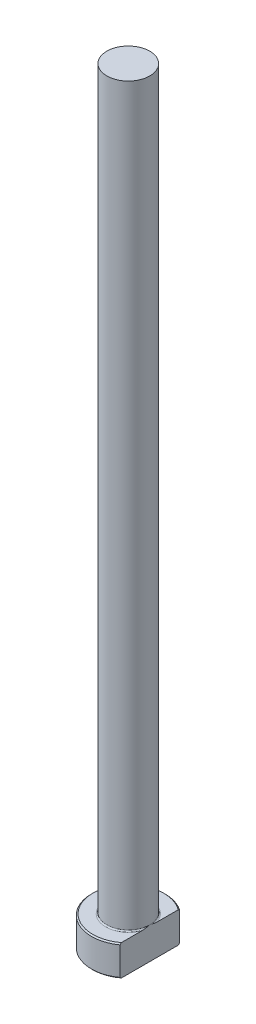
ISO-10303-21;
HEADER;
FILE_DESCRIPTION(('STEP AP214'),'2;1');
FILE_NAME('part.step','',(''),(''),'','','');
FILE_SCHEMA(('AUTOMOTIVE_DESIGN { 1 0 10303 214 1 1 1 1 }'));
ENDSEC;
DATA;
#1=APPLICATION_CONTEXT('core data for automotive mechanical design processes');
#2=APPLICATION_PROTOCOL_DEFINITION('international standard','automotive_design',2000,#1);
#3=PRODUCT_CONTEXT('',#1,'mechanical');
#4=PRODUCT('Part','Part','',(#3));
#5=PRODUCT_RELATED_PRODUCT_CATEGORY('part','',(#4));
#6=PRODUCT_DEFINITION_FORMATION('','',#4);
#7=PRODUCT_DEFINITION_CONTEXT('part definition',#1,'design');
#8=PRODUCT_DEFINITION('design','',#6,#7);
#9=PRODUCT_DEFINITION_SHAPE('','',#8);
#10=(LENGTH_UNIT() NAMED_UNIT(*) SI_UNIT(.MILLI.,.METRE.));
#11=(NAMED_UNIT(*) PLANE_ANGLE_UNIT() SI_UNIT($,.RADIAN.));
#12=(NAMED_UNIT(*) SI_UNIT($,.STERADIAN.) SOLID_ANGLE_UNIT());
#13=UNCERTAINTY_MEASURE_WITH_UNIT(LENGTH_MEASURE(1.E-05),#10,'distance_accuracy_value','');
#14=(GEOMETRIC_REPRESENTATION_CONTEXT(3) GLOBAL_UNCERTAINTY_ASSIGNED_CONTEXT((#13)) GLOBAL_UNIT_ASSIGNED_CONTEXT((#10,
#11,#12)) REPRESENTATION_CONTEXT('',''));
#15=CARTESIAN_POINT('',(0.,0.,0.));
#16=DIRECTION('',(0.,0.,1.));
#17=DIRECTION('',(1.,0.,0.));
#18=AXIS2_PLACEMENT_3D('',#15,#16,#17);
#19=CARTESIAN_POINT('',(0.,0.,0.));
#20=DIRECTION('',(0.,-1.,0.));
#21=DIRECTION('',(0.,0.,-1.));
#22=AXIS2_PLACEMENT_3D('',#19,#20,#21);
#23=PLANE('',#22);
#24=CARTESIAN_POINT('',(0.,0.,0.));
#25=DIRECTION('',(0.,-1.,0.));
#26=DIRECTION('',(0.,0.,-1.));
#27=AXIS2_PLACEMENT_3D('',#24,#25,#26);
#28=CIRCLE('',#27,5.79999999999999);
#29=CARTESIAN_POINT('',(3.49999999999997,0.,4.62493243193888));
#30=VERTEX_POINT('',#29);
#31=CARTESIAN_POINT('',(3.49999999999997,0.,-4.62493243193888));
#32=VERTEX_POINT('',#31);
#33=EDGE_CURVE('E98',#30,#32,#28,.T.);
#34=ORIENTED_EDGE('',*,*,#33,.T.);
#35=DIRECTION('',(0.,0.,1.));
#36=VECTOR('',#35,1.);
#37=CARTESIAN_POINT('',(3.49999999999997,0.,-4.87339717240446));
#38=LINE('',#37,#36);
#39=EDGE_CURVE('E83',#32,#30,#38,.T.);
#40=ORIENTED_EDGE('',*,*,#39,.T.);
#41=EDGE_LOOP('',(#34,#40));
#42=FACE_BOUND('',#41,.T.);
#43=ADVANCED_FACE('F32',(#42),#23,.T.);
#44=CARTESIAN_POINT('',(0.,259.958771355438,0.));
#45=DIRECTION('',(0.,1.,0.));
#46=DIRECTION('',(0.,0.,1.));
#47=AXIS2_PLACEMENT_3D('',#44,#45,#46);
#48=CYLINDRICAL_SURFACE('',#47,5.99999999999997);
#49=CARTESIAN_POINT('',(0.,4.79999999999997,0.));
#50=DIRECTION('',(0.,1.,0.));
#51=DIRECTION('',(0.,0.,1.));
#52=AXIS2_PLACEMENT_3D('',#49,#50,#51);
#53=CIRCLE('',#52,5.99999999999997);
#54=CARTESIAN_POINT('',(3.49999999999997,4.79999999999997,4.87339717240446));
#55=VERTEX_POINT('',#54);
#56=CARTESIAN_POINT('',(3.49999999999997,4.79999999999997,-4.87339717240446));
#57=VERTEX_POINT('',#56);
#58=EDGE_CURVE('E104',#55,#57,#53,.F.);
#59=ORIENTED_EDGE('',*,*,#58,.T.);
#60=DIRECTION('',(0.,-1.,0.));
#61=VECTOR('',#60,1.);
#62=CARTESIAN_POINT('',(3.49999999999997,125.,-4.87339717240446));
#63=LINE('',#62,#61);
#64=CARTESIAN_POINT('',(3.49999999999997,0.199999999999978,-4.87339717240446));
#65=VERTEX_POINT('',#64);
#66=EDGE_CURVE('E183',#57,#65,#63,.T.);
#67=ORIENTED_EDGE('',*,*,#66,.T.);
#68=CARTESIAN_POINT('',(0.,0.199999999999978,0.));
#69=DIRECTION('',(0.,-1.,0.));
#70=DIRECTION('',(0.,0.,-1.));
#71=AXIS2_PLACEMENT_3D('',#68,#69,#70);
#72=CIRCLE('',#71,5.99999999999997);
#73=CARTESIAN_POINT('',(3.49999999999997,0.199999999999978,4.87339717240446));
#74=VERTEX_POINT('',#73);
#75=EDGE_CURVE('E100',#65,#74,#72,.F.);
#76=ORIENTED_EDGE('',*,*,#75,.T.);
#77=DIRECTION('',(0.,-1.,0.));
#78=VECTOR('',#77,1.);
#79=CARTESIAN_POINT('',(3.49999999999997,125.,4.87339717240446));
#80=LINE('',#79,#78);
#81=EDGE_CURVE('E93',#55,#74,#80,.T.);
#82=ORIENTED_EDGE('',*,*,#81,.F.);
#83=EDGE_LOOP('',(#59,#67,#76,#82));
#84=FACE_BOUND('',#83,.T.);
#85=ADVANCED_FACE('F158',(#84),#48,.T.);
#86=CARTESIAN_POINT('',(-5.99999999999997,5.,0.));
#87=DIRECTION('',(0.,1.,0.));
#88=DIRECTION('',(0.,0.,1.));
#89=AXIS2_PLACEMENT_3D('',#86,#87,#88);
#90=PLANE('',#89);
#91=CARTESIAN_POINT('',(0.,5.,0.));
#92=DIRECTION('',(0.,1.,0.));
#93=DIRECTION('',(0.,0.,1.));
#94=AXIS2_PLACEMENT_3D('',#91,#92,#93);
#95=CIRCLE('',#94,5.79999999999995);
#96=CARTESIAN_POINT('',(3.49999999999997,5.,-4.62493243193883));
#97=VERTEX_POINT('',#96);
#98=CARTESIAN_POINT('',(3.49999999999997,5.,4.62493243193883));
#99=VERTEX_POINT('',#98);
#100=EDGE_CURVE('E178',#97,#99,#95,.T.);
#101=ORIENTED_EDGE('',*,*,#100,.T.);
#102=DIRECTION('',(0.,0.,-1.));
#103=VECTOR('',#102,1.);
#104=CARTESIAN_POINT('',(3.49999999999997,5.,0.));
#105=LINE('',#104,#103);
#106=CARTESIAN_POINT('',(3.49999999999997,4.99999999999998,1.19999999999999));
#107=VERTEX_POINT('',#106);
#108=EDGE_CURVE('E57',#99,#107,#105,.T.);
#109=ORIENTED_EDGE('',*,*,#108,.T.);
#110=CARTESIAN_POINT('',(0.,5.,0.));
#111=DIRECTION('',(0.,1.,0.));
#112=DIRECTION('',(0.,0.,1.));
#113=AXIS2_PLACEMENT_3D('',#110,#111,#112);
#114=CIRCLE('',#113,3.69999999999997);
#115=CARTESIAN_POINT('',(3.49999999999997,4.99999999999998,-1.19999999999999));
#116=VERTEX_POINT('',#115);
#117=EDGE_CURVE('E107',#107,#116,#114,.F.);
#118=ORIENTED_EDGE('',*,*,#117,.T.);
#119=EDGE_CURVE('E136',#116,#97,#105,.T.);
#120=ORIENTED_EDGE('',*,*,#119,.T.);
#121=EDGE_LOOP('',(#101,#109,#118,#120));
#122=FACE_BOUND('',#121,.T.);
#123=ADVANCED_FACE('F147',(#122),#90,.T.);
#124=CARTESIAN_POINT('',(0.,5.,0.));
#125=DIRECTION('',(0.,-1.,0.));
#126=DIRECTION('',(0.,0.,-1.));
#127=AXIS2_PLACEMENT_3D('',#124,#125,#126);
#128=CONICAL_SURFACE('',#127,5.79999999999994,0.785398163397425);
#129=ORIENTED_EDGE('',*,*,#58,.F.);
#130=CARTESIAN_POINT('',(3.49999999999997,-0.479658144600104,10.7229048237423));
#131=CARTESIAN_POINT('',(3.49999999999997,-0.304627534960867,10.5387821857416));
#132=CARTESIAN_POINT('',(3.49999999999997,-0.129820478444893,10.3544468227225));
#133=CARTESIAN_POINT('',(3.49999999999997,0.219261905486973,9.9852712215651));
#134=CARTESIAN_POINT('',(3.49999999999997,0.393537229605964,9.80043098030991));
#135=CARTESIAN_POINT('',(3.49999999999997,0.915594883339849,9.24486752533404));
#136=CARTESIAN_POINT('',(3.49999999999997,1.26244829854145,8.87327020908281));
#137=CARTESIAN_POINT('',(3.49999999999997,1.95718621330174,8.12195979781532));
#138=CARTESIAN_POINT('',(3.49999999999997,2.30502483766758,7.74220412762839));
#139=CARTESIAN_POINT('',(3.49999999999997,2.82267860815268,7.16898192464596));
#140=CARTESIAN_POINT('',(3.49999999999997,2.99451670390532,6.97734293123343));
#141=CARTESIAN_POINT('',(3.49999999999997,3.3364922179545,6.59255347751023));
#142=CARTESIAN_POINT('',(3.49999999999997,3.50662964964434,6.39940302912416));
#143=CARTESIAN_POINT('',(3.49999999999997,3.80984794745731,6.05127590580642));
#144=CARTESIAN_POINT('',(3.49999999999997,3.94332939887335,5.89664839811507));
#145=CARTESIAN_POINT('',(3.49999999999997,4.20861192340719,5.58595941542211));
#146=CARTESIAN_POINT('',(3.49999999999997,4.34041301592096,5.42989795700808));
#147=CARTESIAN_POINT('',(3.49999999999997,4.60204886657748,5.11587234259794));
#148=CARTESIAN_POINT('',(3.49999999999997,4.73188156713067,4.95790646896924));
#149=CARTESIAN_POINT('',(3.49999999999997,4.98887681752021,4.63982145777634));
#150=CARTESIAN_POINT('',(3.49999999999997,5.11603946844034,4.479702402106));
#151=CARTESIAN_POINT('',(3.49999999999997,5.36664013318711,4.1571264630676));
#152=CARTESIAN_POINT('',(3.49999999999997,5.49008567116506,3.99467544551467));
#153=CARTESIAN_POINT('',(3.49999999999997,5.73245687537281,3.6663703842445));
#154=CARTESIAN_POINT('',(3.49999999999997,5.85138169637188,3.50051571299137));
#155=CARTESIAN_POINT('',(3.49999999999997,6.08288587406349,3.16479623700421));
#156=CARTESIAN_POINT('',(3.49999999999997,6.19547497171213,2.99493819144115));
#157=CARTESIAN_POINT('',(3.49999999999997,6.41208556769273,2.64987956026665));
#158=CARTESIAN_POINT('',(3.49999999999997,6.5161111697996,2.47468158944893));
#159=CARTESIAN_POINT('',(3.49999999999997,6.68667355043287,2.16371702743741));
#160=CARTESIAN_POINT('',(3.49999999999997,6.75595020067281,2.02946380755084));
#161=CARTESIAN_POINT('',(3.49999999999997,6.88572771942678,1.75668071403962));
#162=CARTESIAN_POINT('',(3.49999999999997,6.94622644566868,1.61814980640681));
#163=CARTESIAN_POINT('',(3.49999999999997,7.05535730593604,1.33751093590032));
#164=CARTESIAN_POINT('',(3.49999999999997,7.10406788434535,1.19543397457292));
#165=CARTESIAN_POINT('',(3.49999999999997,7.18698872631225,0.907101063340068));
#166=CARTESIAN_POINT('',(3.49999999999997,7.22121012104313,0.76084841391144));
#167=CARTESIAN_POINT('',(3.49999999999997,7.26487302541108,0.507831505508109));
#168=CARTESIAN_POINT('',(3.49999999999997,7.27861043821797,0.401805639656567));
#169=CARTESIAN_POINT('',(3.49999999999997,7.29650595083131,0.188947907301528));
#170=CARTESIAN_POINT('',(3.49999999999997,7.30066582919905,0.0821161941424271));
#171=CARTESIAN_POINT('',(3.49999999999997,7.29916002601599,-0.131492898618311));
#172=CARTESIAN_POINT('',(3.49999999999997,7.29349282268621,-0.238270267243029));
#173=CARTESIAN_POINT('',(3.49999999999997,7.27266406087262,-0.450895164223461));
#174=CARTESIAN_POINT('',(3.49999999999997,7.25750065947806,-0.556742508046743));
#175=CARTESIAN_POINT('',(3.49999999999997,7.21256554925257,-0.798589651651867));
#176=CARTESIAN_POINT('',(3.49999999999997,7.17976248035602,-0.934025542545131));
#177=CARTESIAN_POINT('',(3.49999999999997,7.10180151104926,-1.20127435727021));
#178=CARTESIAN_POINT('',(3.49999999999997,7.05663717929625,-1.33308535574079));
#179=CARTESIAN_POINT('',(3.49999999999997,6.95617548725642,-1.59358719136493));
#180=CARTESIAN_POINT('',(3.49999999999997,6.90082290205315,-1.72225647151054));
#181=CARTESIAN_POINT('',(3.49999999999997,6.81196782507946,-1.9124686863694));
#182=CARTESIAN_POINT('',(3.49999999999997,6.78138093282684,-1.97540288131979));
#183=CARTESIAN_POINT('',(3.49999999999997,6.71848328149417,-2.1004037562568));
#184=CARTESIAN_POINT('',(3.49999999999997,6.68617255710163,-2.1624704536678));
#185=CARTESIAN_POINT('',(3.49999999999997,6.59348343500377,-2.33529342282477));
#186=CARTESIAN_POINT('',(3.49999999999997,6.53139715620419,-2.44513435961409));
#187=CARTESIAN_POINT('',(3.49999999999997,6.40327495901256,-2.66249790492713));
#188=CARTESIAN_POINT('',(3.49999999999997,6.33723828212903,-2.77002006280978));
#189=CARTESIAN_POINT('',(3.49999999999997,6.20193961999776,-2.9831092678));
#190=CARTESIAN_POINT('',(3.49999999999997,6.13267551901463,-3.08867496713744));
#191=CARTESIAN_POINT('',(3.49999999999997,5.99154722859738,-3.29805772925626));
#192=CARTESIAN_POINT('',(3.49999999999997,5.91968285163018,-3.40187466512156));
#193=CARTESIAN_POINT('',(3.49999999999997,5.70053198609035,-3.71160333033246));
#194=CARTESIAN_POINT('',(3.49999999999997,5.55004115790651,-3.91524708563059));
#195=CARTESIAN_POINT('',(3.49999999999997,5.24323373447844,-4.31793623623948));
#196=CARTESIAN_POINT('',(3.49999999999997,5.08691924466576,-4.51698325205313));
#197=CARTESIAN_POINT('',(3.49999999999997,4.76917008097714,-4.91272714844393));
#198=CARTESIAN_POINT('',(3.49999999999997,4.60771212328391,-5.10940527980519));
#199=CARTESIAN_POINT('',(3.49999999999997,4.28159454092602,-5.50010578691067));
#200=CARTESIAN_POINT('',(3.49999999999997,4.1169346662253,-5.69412795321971));
#201=CARTESIAN_POINT('',(3.49999999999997,3.78544370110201,-6.07977702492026));
#202=CARTESIAN_POINT('',(3.49999999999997,3.61861641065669,-6.27140720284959));
#203=CARTESIAN_POINT('',(3.49999999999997,3.28306967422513,-6.65300504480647));
#204=CARTESIAN_POINT('',(3.49999999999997,3.11435020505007,-6.84297268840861));
#205=CARTESIAN_POINT('',(3.49999999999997,2.66324311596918,-7.34687370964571));
#206=CARTESIAN_POINT('',(3.49999999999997,2.37954008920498,-7.65962881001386));
#207=CARTESIAN_POINT('',(3.49999999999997,1.80910784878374,-8.28261634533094));
#208=CARTESIAN_POINT('',(3.49999999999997,1.52237733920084,-8.59284759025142));
#209=CARTESIAN_POINT('',(3.49999999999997,0.950562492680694,-9.2072768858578));
#210=CARTESIAN_POINT('',(3.49999999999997,0.665505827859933,-9.5115007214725));
#211=CARTESIAN_POINT('',(3.49999999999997,0.0939335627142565,-10.118297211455));
#212=CARTESIAN_POINT('',(3.49999999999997,-0.192581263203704,-10.4208705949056));
#213=CARTESIAN_POINT('',(3.49999999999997,-0.479658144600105,-10.7229048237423));
#214=B_SPLINE_CURVE_WITH_KNOTS('',3,(#130,#131,#132,#133,#134,#135,#136,#137,#138,#139,#140,
#141,#142,#143,#144,#145,#146,#147,#148,#149,#150,#151,#152,#153,#154,#155,#156,#157,#158,#159,
#160,#161,#162,#163,#164,#165,#166,#167,#168,#169,#170,#171,#172,#173,#174,#175,#176,#177,#178,
#179,#180,#181,#182,#183,#184,#185,#186,#187,#188,#189,#190,#191,#192,#193,#194,#195,#196,#197,
#198,#199,#200,#201,#202,#203,#204,#205,#206,#207,#208,#209,#210,#211,#212,#213),.UNSPECIFIED.,
.F.,.F.,(4,2,2,2,2,2,2,2,2,2,2,2,2,2,2,2,2,2,2,2,2,2,2,2,2,2,2,2,2,2,2,2,2,2,2,2,2,2,2,2,2,4),
(0.,0.762123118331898,1.52425095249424,3.04920520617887,4.59410962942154,5.36629689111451,
6.13847806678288,6.75128402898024,7.36408291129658,7.97748343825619,8.59086070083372,
9.20289910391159,9.81505138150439,10.4262352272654,11.0371244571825,11.4901076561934,
11.9432012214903,12.3931912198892,12.8428348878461,13.1631796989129,13.4834650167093,
13.8037999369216,14.1241970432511,14.5415079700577,14.9590364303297,15.3788985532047,
15.5887982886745,15.7986938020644,16.1771020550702,16.5555831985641,16.9343160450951,
17.3130762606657,18.0725457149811,18.8317432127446,19.5950831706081,20.3584829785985,
21.1206884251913,21.8829032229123,23.1496528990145,24.4169687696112,25.6676760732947,
26.9177769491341),.UNSPECIFIED.);
#215=EDGE_CURVE('E135',#55,#99,#214,.T.);
#216=ORIENTED_EDGE('',*,*,#215,.T.);
#217=ORIENTED_EDGE('',*,*,#100,.F.);
#218=EDGE_CURVE('E127',#97,#57,#214,.T.);
#219=ORIENTED_EDGE('',*,*,#218,.T.);
#220=EDGE_LOOP('',(#129,#216,#217,#219));
#221=FACE_BOUND('',#220,.T.);
#222=ADVANCED_FACE('F143',(#221),#128,.T.);
#223=CARTESIAN_POINT('',(0.,0.199999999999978,0.));
#224=DIRECTION('',(0.,1.,0.));
#225=DIRECTION('',(0.,0.,1.));
#226=AXIS2_PLACEMENT_3D('',#223,#224,#225);
#227=CONICAL_SURFACE('',#226,5.99999999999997,0.785398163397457);
#228=ORIENTED_EDGE('',*,*,#75,.F.);
#229=CARTESIAN_POINT('',(3.49999999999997,5.47965814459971,-10.7229048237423));
#230=CARTESIAN_POINT('',(3.49999999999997,5.30462753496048,-10.5387821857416));
#231=CARTESIAN_POINT('',(3.49999999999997,5.12982047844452,-10.3544468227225));
#232=CARTESIAN_POINT('',(3.49999999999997,4.78073809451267,-9.98527122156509));
#233=CARTESIAN_POINT('',(3.49999999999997,4.60646277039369,-9.8004309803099));
#234=CARTESIAN_POINT('',(3.49999999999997,4.08440511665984,-9.24486752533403));
#235=CARTESIAN_POINT('',(3.49999999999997,3.73755170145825,-8.8732702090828));
#236=CARTESIAN_POINT('',(3.49999999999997,3.042813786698,-8.12195979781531));
#237=CARTESIAN_POINT('',(3.49999999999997,2.69497516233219,-7.74220412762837));
#238=CARTESIAN_POINT('',(3.49999999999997,2.17732139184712,-7.16898192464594));
#239=CARTESIAN_POINT('',(3.49999999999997,2.00548329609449,-6.9773429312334));
#240=CARTESIAN_POINT('',(3.49999999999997,1.66350778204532,-6.5925534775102));
#241=CARTESIAN_POINT('',(3.49999999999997,1.4933703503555,-6.39940302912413));
#242=CARTESIAN_POINT('',(3.49999999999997,1.19015205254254,-6.05127590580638));
#243=CARTESIAN_POINT('',(3.49999999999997,1.05667060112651,-5.89664839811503));
#244=CARTESIAN_POINT('',(3.49999999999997,0.791388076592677,-5.58595941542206));
#245=CARTESIAN_POINT('',(3.49999999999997,0.659586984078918,-5.42989795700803));
#246=CARTESIAN_POINT('',(3.49999999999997,0.397951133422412,-5.11587234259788));
#247=CARTESIAN_POINT('',(3.49999999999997,0.268118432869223,-4.95790646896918));
#248=CARTESIAN_POINT('',(3.49999999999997,0.0111231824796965,-4.63982145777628));
#249=CARTESIAN_POINT('',(3.49999999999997,-0.11603946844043,-4.47970240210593));
#250=CARTESIAN_POINT('',(3.49999999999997,-0.366640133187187,-4.15712646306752));
#251=CARTESIAN_POINT('',(3.49999999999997,-0.490085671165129,-3.99467544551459));
#252=CARTESIAN_POINT('',(3.49999999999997,-0.73245687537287,-3.66637038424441));
#253=CARTESIAN_POINT('',(3.49999999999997,-0.851381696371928,-3.50051571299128));
#254=CARTESIAN_POINT('',(3.49999999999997,-1.08288587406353,-3.16479623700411));
#255=CARTESIAN_POINT('',(3.49999999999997,-1.19547497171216,-2.99493819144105));
#256=CARTESIAN_POINT('',(3.49999999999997,-1.41208556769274,-2.64987956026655));
#257=CARTESIAN_POINT('',(3.49999999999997,-1.5161111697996,-2.47468158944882));
#258=CARTESIAN_POINT('',(3.49999999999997,-1.68667355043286,-2.16371702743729));
#259=CARTESIAN_POINT('',(3.49999999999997,-1.7559502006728,-2.02946380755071));
#260=CARTESIAN_POINT('',(3.49999999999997,-1.88572771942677,-1.75668071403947));
#261=CARTESIAN_POINT('',(3.49999999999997,-1.94622644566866,-1.61814980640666));
#262=CARTESIAN_POINT('',(3.49999999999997,-2.05535730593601,-1.33751093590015));
#263=CARTESIAN_POINT('',(3.49999999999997,-2.10406788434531,-1.19543397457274));
#264=CARTESIAN_POINT('',(3.49999999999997,-2.18698872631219,-0.907101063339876));
#265=CARTESIAN_POINT('',(3.49999999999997,-2.22121012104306,-0.760848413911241));
#266=CARTESIAN_POINT('',(3.49999999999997,-2.26487302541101,-0.507831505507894));
#267=CARTESIAN_POINT('',(3.49999999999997,-2.27861043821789,-0.401805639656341));
#268=CARTESIAN_POINT('',(3.49999999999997,-2.29650595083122,-0.188947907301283));
#269=CARTESIAN_POINT('',(3.49999999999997,-2.30066582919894,-0.0821161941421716));
#270=CARTESIAN_POINT('',(3.49999999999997,-2.29916002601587,0.131492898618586));
#271=CARTESIAN_POINT('',(3.49999999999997,-2.29349282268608,0.238270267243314));
#272=CARTESIAN_POINT('',(3.49999999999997,-2.27266406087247,0.450895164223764));
#273=CARTESIAN_POINT('',(3.49999999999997,-2.2575006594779,0.556742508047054));
#274=CARTESIAN_POINT('',(3.49999999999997,-2.21256554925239,0.798589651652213));
#275=CARTESIAN_POINT('',(3.49999999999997,-2.17976248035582,0.934025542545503));
#276=CARTESIAN_POINT('',(3.49999999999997,-2.10180151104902,1.20127435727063));
#277=CARTESIAN_POINT('',(3.49999999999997,-2.05663717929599,1.33308535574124));
#278=CARTESIAN_POINT('',(3.49999999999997,-1.95617548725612,1.59358719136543));
#279=CARTESIAN_POINT('',(3.49999999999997,-1.90082290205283,1.72225647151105));
#280=CARTESIAN_POINT('',(3.49999999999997,-1.81196782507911,1.91246868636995));
#281=CARTESIAN_POINT('',(3.49999999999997,-1.78138093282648,1.97540288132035));
#282=CARTESIAN_POINT('',(3.49999999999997,-1.71848328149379,2.10040375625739));
#283=CARTESIAN_POINT('',(3.49999999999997,-1.68617255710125,2.1624704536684));
#284=CARTESIAN_POINT('',(3.49999999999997,-1.59348343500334,2.33529342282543));
#285=CARTESIAN_POINT('',(3.49999999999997,-1.53139715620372,2.44513435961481));
#286=CARTESIAN_POINT('',(3.49999999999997,-1.40327495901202,2.66249790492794));
#287=CARTESIAN_POINT('',(3.49999999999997,-1.33723828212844,2.77002006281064));
#288=CARTESIAN_POINT('',(3.49999999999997,-1.20193961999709,2.98310926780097));
#289=CARTESIAN_POINT('',(3.49999999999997,-1.13267551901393,3.08867496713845));
#290=CARTESIAN_POINT('',(3.49999999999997,-0.991547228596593,3.29805772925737));
#291=CARTESIAN_POINT('',(3.49999999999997,-0.919682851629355,3.40187466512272));
#292=CARTESIAN_POINT('',(3.49999999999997,-0.700531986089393,3.71160333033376));
#293=CARTESIAN_POINT('',(3.49999999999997,-0.550041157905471,3.91524708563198));
#294=CARTESIAN_POINT('',(3.49999999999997,-0.243233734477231,4.31793623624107));
#295=CARTESIAN_POINT('',(3.49999999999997,-0.0869192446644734,4.5169832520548));
#296=CARTESIAN_POINT('',(3.49999999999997,0.230829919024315,4.91272714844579));
#297=CARTESIAN_POINT('',(3.49999999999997,0.392287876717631,5.10940527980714));
#298=CARTESIAN_POINT('',(3.49999999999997,0.718405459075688,5.50010578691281));
#299=CARTESIAN_POINT('',(3.49999999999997,0.883065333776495,5.69412795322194));
#300=CARTESIAN_POINT('',(3.49999999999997,1.21455629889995,6.07977702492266));
#301=CARTESIAN_POINT('',(3.49999999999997,1.38138358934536,6.27140720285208));
#302=CARTESIAN_POINT('',(3.49999999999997,1.71693032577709,6.65300504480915));
#303=CARTESIAN_POINT('',(3.49999999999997,1.88564979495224,6.84297268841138));
#304=CARTESIAN_POINT('',(3.49999999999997,2.33675688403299,7.34687370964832));
#305=CARTESIAN_POINT('',(3.49999999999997,2.62045991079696,7.65962881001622));
#306=CARTESIAN_POINT('',(3.49999999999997,3.19089215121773,8.28261634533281));
#307=CARTESIAN_POINT('',(3.49999999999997,3.4776226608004,8.59284759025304));
#308=CARTESIAN_POINT('',(3.49999999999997,4.04943750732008,9.20727688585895));
#309=CARTESIAN_POINT('',(3.49999999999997,4.33449417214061,9.51150072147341));
#310=CARTESIAN_POINT('',(3.49999999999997,4.90606643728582,10.1182972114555));
#311=CARTESIAN_POINT('',(3.49999999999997,5.19258126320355,10.4208705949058));
#312=CARTESIAN_POINT('',(3.49999999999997,5.47965814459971,10.7229048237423));
#313=B_SPLINE_CURVE_WITH_KNOTS('',3,(#229,#230,#231,#232,#233,#234,#235,#236,#237,#238,#239,
#240,#241,#242,#243,#244,#245,#246,#247,#248,#249,#250,#251,#252,#253,#254,#255,#256,#257,#258,
#259,#260,#261,#262,#263,#264,#265,#266,#267,#268,#269,#270,#271,#272,#273,#274,#275,#276,#277,
#278,#279,#280,#281,#282,#283,#284,#285,#286,#287,#288,#289,#290,#291,#292,#293,#294,#295,#296,
#297,#298,#299,#300,#301,#302,#303,#304,#305,#306,#307,#308,#309,#310,#311,#312),.UNSPECIFIED.,
.F.,.F.,(4,2,2,2,2,2,2,2,2,2,2,2,2,2,2,2,2,2,2,2,2,2,2,2,2,2,2,2,2,2,2,2,2,2,2,2,2,2,2,2,2,4),
(0.,0.762123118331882,1.52425095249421,3.0492052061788,4.59410962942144,5.36629689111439,
6.13847806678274,6.7512840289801,7.36408291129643,7.97748343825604,8.59086070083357,
9.20289910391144,9.81505138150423,10.4262352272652,11.0371244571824,11.4901076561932,
11.9432012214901,12.3931912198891,12.842834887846,13.1631796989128,13.4834650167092,
13.8037999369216,14.1241970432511,14.5415079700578,14.9590364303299,15.378898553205,
15.5887982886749,15.7986938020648,16.1771020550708,16.5555831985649,16.934316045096,
17.3130762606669,18.0725457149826,18.8317432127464,19.5950831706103,20.3584829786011,
21.1206884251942,21.8829032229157,23.1496528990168,24.4169687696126,25.667676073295,
26.9177769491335),.UNSPECIFIED.);
#314=EDGE_CURVE('E86',#65,#32,#313,.T.);
#315=ORIENTED_EDGE('',*,*,#314,.T.);
#316=ORIENTED_EDGE('',*,*,#33,.F.);
#317=EDGE_CURVE('E89',#30,#74,#313,.T.);
#318=ORIENTED_EDGE('',*,*,#317,.T.);
#319=EDGE_LOOP('',(#228,#315,#316,#318));
#320=FACE_BOUND('',#319,.T.);
#321=ADVANCED_FACE('F97',(#320),#227,.T.);
#322=CARTESIAN_POINT('',(0.,5.19999999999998,0.));
#323=DIRECTION('',(0.,1.,0.));
#324=DIRECTION('',(0.,0.,1.));
#325=AXIS2_PLACEMENT_3D('',#322,#323,#324);
#326=TOROIDAL_SURFACE('',#325,3.69999999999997,0.2);
#327=CARTESIAN_POINT('',(3.49999999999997,5.19999999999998,0.));
#328=CARTESIAN_POINT('',(3.49999999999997,5.20000050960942,9.98094828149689E-11));
#329=CARTESIAN_POINT('',(3.49999999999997,5.20000101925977,-2.13486746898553E-07));
#330=CARTESIAN_POINT('',(3.49999999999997,5.20000196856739,-7.957591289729E-07));
#331=CARTESIAN_POINT('',(3.49999999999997,5.20000239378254,-1.17925839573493E-06));
#332=CARTESIAN_POINT('',(3.49999999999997,5.20000328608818,-2.10014972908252E-06));
#333=CARTESIAN_POINT('',(3.49999999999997,5.20000373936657,-2.65249908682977E-06));
#334=CARTESIAN_POINT('',(3.49999999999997,5.20000454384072,-3.79112889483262E-06));
#335=CARTESIAN_POINT('',(3.49999999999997,5.20000489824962,-4.37533521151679E-06));
#336=CARTESIAN_POINT('',(3.49999999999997,5.20000623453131,-6.66270059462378E-06));
#337=CARTESIAN_POINT('',(3.49999999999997,5.20000714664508,-8.40961025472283E-06));
#338=CARTESIAN_POINT('',(3.49999999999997,5.20000862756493,-1.18496824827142E-05));
#339=CARTESIAN_POINT('',(3.49999999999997,5.20000922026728,-1.35329548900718E-05));
#340=CARTESIAN_POINT('',(3.49999999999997,5.20001174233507,-2.07268950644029E-05));
#341=CARTESIAN_POINT('',(3.49999999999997,5.20001365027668,-2.62477536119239E-05));
#342=CARTESIAN_POINT('',(3.49999999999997,5.20001642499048,-3.66274572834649E-05));
#343=CARTESIAN_POINT('',(3.49999999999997,5.20001740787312,-4.14549355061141E-05));
#344=CARTESIAN_POINT('',(3.49999999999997,5.20002462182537,-7.75352102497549E-05));
#345=CARTESIAN_POINT('',(3.49999999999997,5.20003014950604,-0.000108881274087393));
#346=CARTESIAN_POINT('',(3.49999999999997,5.20005434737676,-0.000233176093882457));
#347=CARTESIAN_POINT('',(3.49999999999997,5.20007737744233,-0.000325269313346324));
#348=CARTESIAN_POINT('',(3.49999999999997,5.20016742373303,-0.000691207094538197));
#349=CARTESIAN_POINT('',(3.49999999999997,5.20023166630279,-0.000965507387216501));
#350=CARTESIAN_POINT('',(3.49999999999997,5.20048971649,-0.0020594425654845));
#351=CARTESIAN_POINT('',(3.49999999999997,5.20068705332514,-0.00287847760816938));
#352=CARTESIAN_POINT('',(3.49999999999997,5.20150941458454,-0.00630050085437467));
#353=CARTESIAN_POINT('',(3.49999999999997,5.20212997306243,-0.00890424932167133));
#354=CARTESIAN_POINT('',(3.49999999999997,5.20703918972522,-0.0294912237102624));
#355=CARTESIAN_POINT('',(3.49999999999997,5.21134300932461,-0.0474719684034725));
#356=CARTESIAN_POINT('',(3.49999999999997,5.21975360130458,-0.0827191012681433));
#357=CARTESIAN_POINT('',(3.49999999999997,5.22386136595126,-0.0999852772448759));
#358=CARTESIAN_POINT('',(3.49999999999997,5.2372401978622,-0.156405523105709));
#359=CARTESIAN_POINT('',(3.49999999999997,5.24645854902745,-0.195572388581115));
#360=CARTESIAN_POINT('',(3.49999999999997,5.26203234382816,-0.262828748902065));
#361=CARTESIAN_POINT('',(3.49999999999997,5.26845671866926,-0.290902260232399));
#362=CARTESIAN_POINT('',(3.49999999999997,5.28094671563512,-0.346379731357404));
#363=CARTESIAN_POINT('',(3.49999999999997,5.28701730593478,-0.373782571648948));
#364=CARTESIAN_POINT('',(3.49999999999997,5.30077691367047,-0.437211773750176));
#365=CARTESIAN_POINT('',(3.49999999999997,5.3083789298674,-0.473257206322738));
#366=CARTESIAN_POINT('',(3.49999999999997,5.32309409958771,-0.545736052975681));
#367=CARTESIAN_POINT('',(3.49999999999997,5.33020304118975,-0.582170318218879));
#368=CARTESIAN_POINT('',(3.49999999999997,5.35161649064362,-0.697757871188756));
#369=CARTESIAN_POINT('',(3.49999999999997,5.36463967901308,-0.777158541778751));
#370=CARTESIAN_POINT('',(3.49999999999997,5.3843837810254,-0.92756184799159));
#371=CARTESIAN_POINT('',(3.49999999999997,5.39165512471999,-0.998486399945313));
#372=CARTESIAN_POINT('',(3.49999999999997,5.3979989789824,-1.10437287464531));
#373=CARTESIAN_POINT('',(3.49999999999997,5.39936233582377,-1.13919451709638));
#374=CARTESIAN_POINT('',(3.49999999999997,5.40028946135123,-1.20885098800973));
#375=CARTESIAN_POINT('',(3.49999999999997,5.39985418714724,-1.24368579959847));
#376=CARTESIAN_POINT('',(3.49999999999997,5.39686573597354,-1.30963279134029));
#377=CARTESIAN_POINT('',(3.49999999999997,5.39453835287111,-1.34075403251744));
#378=CARTESIAN_POINT('',(3.49999999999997,5.38750048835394,-1.40298456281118));
#379=CARTESIAN_POINT('',(3.49999999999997,5.38277118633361,-1.43409178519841));
#380=CARTESIAN_POINT('',(3.49999999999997,5.37000596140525,-1.49609278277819));
#381=CARTESIAN_POINT('',(3.49999999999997,5.36193044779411,-1.52697933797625));
#382=CARTESIAN_POINT('',(3.49999999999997,5.34614337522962,-1.57192957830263));
#383=CARTESIAN_POINT('',(3.49999999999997,5.3402919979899,-1.5866404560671));
#384=CARTESIAN_POINT('',(3.49999999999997,5.32701491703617,-1.6153215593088));
#385=CARTESIAN_POINT('',(3.49999999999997,5.31959341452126,-1.6292936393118));
#386=CARTESIAN_POINT('',(3.49999999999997,5.30547056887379,-1.65150372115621));
#387=CARTESIAN_POINT('',(3.49999999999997,5.29934759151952,-1.6601058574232));
#388=CARTESIAN_POINT('',(3.49999999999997,5.28595656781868,-1.67637400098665));
#389=CARTESIAN_POINT('',(3.49999999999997,5.27869146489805,-1.68404232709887));
#390=CARTESIAN_POINT('',(3.49999999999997,5.26587375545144,-1.69518467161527));
#391=CARTESIAN_POINT('',(3.49999999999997,5.26073958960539,-1.69913647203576));
#392=CARTESIAN_POINT('',(3.49999999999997,5.24994100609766,-1.70624293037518));
#393=CARTESIAN_POINT('',(3.49999999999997,5.24427723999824,-1.70939855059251));
#394=CARTESIAN_POINT('',(3.49999999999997,5.23351378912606,-1.71418736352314));
#395=CARTESIAN_POINT('',(3.49999999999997,5.22849079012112,-1.71599090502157));
#396=CARTESIAN_POINT('',(3.49999999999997,5.21821361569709,-1.71873268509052));
#397=CARTESIAN_POINT('',(3.49999999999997,5.21295968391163,-1.71967181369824));
#398=CARTESIAN_POINT('',(3.49999999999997,5.20234462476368,-1.72059432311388));
#399=CARTESIAN_POINT('',(3.49999999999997,5.19698314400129,-1.72057373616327));
#400=CARTESIAN_POINT('',(3.49999999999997,5.18635093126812,-1.71956893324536));
#401=CARTESIAN_POINT('',(3.49999999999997,5.18108024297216,-1.71858426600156));
#402=CARTESIAN_POINT('',(3.49999999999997,5.17106869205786,-1.71582968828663));
#403=CARTESIAN_POINT('',(3.49999999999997,5.16631466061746,-1.71410641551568));
#404=CARTESIAN_POINT('',(3.49999999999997,5.15709718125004,-1.71001459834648));
#405=CARTESIAN_POINT('',(3.49999999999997,5.15263381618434,-1.70764587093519));
#406=CARTESIAN_POINT('',(3.49999999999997,5.14110717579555,-1.70060771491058));
#407=CARTESIAN_POINT('',(3.49999999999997,5.13433222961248,-1.69546710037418));
#408=CARTESIAN_POINT('',(3.49999999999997,5.12164557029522,-1.68420869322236));
#409=CARTESIAN_POINT('',(3.49999999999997,5.11573697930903,-1.67808752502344));
#410=CARTESIAN_POINT('',(3.49999999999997,5.10028952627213,-1.66008531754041));
#411=CARTESIAN_POINT('',(3.49999999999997,5.09159238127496,-1.64748936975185));
#412=CARTESIAN_POINT('',(3.49999999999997,5.07604019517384,-1.62125022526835));
#413=CARTESIAN_POINT('',(3.49999999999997,5.06918749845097,-1.60760572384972));
#414=CARTESIAN_POINT('',(3.49999999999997,5.05635908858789,-1.57851190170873));
#415=CARTESIAN_POINT('',(3.49999999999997,5.05050870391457,-1.56300807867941));
#416=CARTESIAN_POINT('',(3.49999999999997,5.04009412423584,-1.53156759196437));
#417=CARTESIAN_POINT('',(3.49999999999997,5.03553147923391,-1.51563043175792));
#418=CARTESIAN_POINT('',(3.49999999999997,5.02331191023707,-1.46712048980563));
#419=CARTESIAN_POINT('',(3.49999999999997,5.01724153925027,-1.4341495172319));
#420=CARTESIAN_POINT('',(3.49999999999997,5.00883071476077,-1.37348993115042));
#421=CARTESIAN_POINT('',(3.49999999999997,5.00603148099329,-1.34585663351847));
#422=CARTESIAN_POINT('',(3.49999999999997,5.00204762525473,-1.29046925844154));
#423=CARTESIAN_POINT('',(3.49999999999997,5.00086336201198,-1.26271515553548));
#424=CARTESIAN_POINT('',(3.49999999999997,4.99925913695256,-1.17922229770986));
#425=CARTESIAN_POINT('',(3.49999999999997,5.00080993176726,-1.1234488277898));
#426=CARTESIAN_POINT('',(3.49999999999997,5.00738569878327,-1.01528124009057));
#427=CARTESIAN_POINT('',(3.49999999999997,5.01221131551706,-0.962872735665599));
#428=CARTESIAN_POINT('',(3.49999999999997,5.02425367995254,-0.858750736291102));
#429=CARTESIAN_POINT('',(3.49999999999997,5.03145152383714,-0.807035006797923));
#430=CARTESIAN_POINT('',(3.49999999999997,5.04786442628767,-0.702500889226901));
#431=CARTESIAN_POINT('',(3.49999999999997,5.05712869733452,-0.649690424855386));
#432=CARTESIAN_POINT('',(3.49999999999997,5.07730630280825,-0.542969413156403));
#433=CARTESIAN_POINT('',(3.49999999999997,5.08825618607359,-0.489065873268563));
#434=CARTESIAN_POINT('',(3.49999999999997,5.10770336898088,-0.397738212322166));
#435=CARTESIAN_POINT('',(3.49999999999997,5.11594150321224,-0.360258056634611));
#436=CARTESIAN_POINT('',(3.49999999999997,5.1326812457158,-0.285797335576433));
#437=CARTESIAN_POINT('',(3.49999999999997,5.14117887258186,-0.248815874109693));
#438=CARTESIAN_POINT('',(3.49999999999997,5.15740628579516,-0.179140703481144));
#439=CARTESIAN_POINT('',(3.49999999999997,5.16511243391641,-0.146441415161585));
#440=CARTESIAN_POINT('',(3.49999999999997,5.18096853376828,-0.0796648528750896));
#441=CARTESIAN_POINT('',(3.49999999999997,5.18912333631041,-0.045588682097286));
#442=CARTESIAN_POINT('',(3.49999999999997,5.19787118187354,-0.00889903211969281));
#443=CARTESIAN_POINT('',(3.49999999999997,5.19849305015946,-0.00629009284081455));
#444=CARTESIAN_POINT('',(3.49999999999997,5.19931571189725,-0.00286690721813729));
#445=CARTESIAN_POINT('',(3.49999999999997,5.19951207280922,-0.0020519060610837));
#446=CARTESIAN_POINT('',(3.49999999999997,5.19976893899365,-0.0009629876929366));
#447=CARTESIAN_POINT('',(3.49999999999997,5.19983295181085,-0.00068966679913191));
#448=CARTESIAN_POINT('',(3.49999999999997,5.19992272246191,-0.000324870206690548));
#449=CARTESIAN_POINT('',(3.49999999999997,5.19994571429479,-0.000232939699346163));
#450=CARTESIAN_POINT('',(3.49999999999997,5.19996987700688,-0.000108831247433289));
#451=CARTESIAN_POINT('',(3.49999999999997,5.19997540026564,-7.75074375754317E-05));
#452=CARTESIAN_POINT('',(3.49999999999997,5.19998260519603,-4.1449950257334E-05));
#453=CARTESIAN_POINT('',(3.49999999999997,5.19998358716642,-3.66236562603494E-05));
#454=CARTESIAN_POINT('',(3.49999999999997,5.19998635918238,-2.62464271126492E-05));
#455=CARTESIAN_POINT('',(3.49999999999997,5.19998826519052,-2.07267962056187E-05));
#456=CARTESIAN_POINT('',(3.49999999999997,5.19999078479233,-1.353414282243E-05));
#457=CARTESIAN_POINT('',(3.49999999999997,5.19999137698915,-1.18509583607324E-05));
#458=CARTESIAN_POINT('',(3.49999999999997,5.19999285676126,-8.4109834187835E-06));
#459=CARTESIAN_POINT('',(3.49999999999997,5.19999376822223,-6.66407126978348E-06));
#460=CARTESIAN_POINT('',(3.49999999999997,5.19999510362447,-4.37661194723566E-06));
#461=CARTESIAN_POINT('',(3.49999999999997,5.19999545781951,-3.79235333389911E-06));
#462=CARTESIAN_POINT('',(3.49999999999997,5.19999626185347,-2.65358032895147E-06));
#463=CARTESIAN_POINT('',(3.49999999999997,5.19999671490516,-2.10113839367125E-06));
#464=CARTESIAN_POINT('',(3.49999999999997,5.1999976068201,-1.18003190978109E-06));
#465=CARTESIAN_POINT('',(3.49999999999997,5.19999803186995,-7.96418762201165E-07));
#466=CARTESIAN_POINT('',(3.49999999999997,5.19999898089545,-2.13855187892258E-07));
#467=CARTESIAN_POINT('',(3.49999999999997,5.19999949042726,-9.98022935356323E-11));
#468=CARTESIAN_POINT('',(3.49999999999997,5.19999999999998,0.));
#469=B_SPLINE_CURVE_WITH_KNOTS('',3,(#327,#328,#329,#330,#331,#332,#333,#334,#335,#336,#337,
#338,#339,#340,#341,#342,#343,#344,#345,#346,#347,#348,#349,#350,#351,#352,#353,#354,#355,#356,
#357,#358,#359,#360,#361,#362,#363,#364,#365,#366,#367,#368,#369,#370,#371,#372,#373,#374,#375,
#376,#377,#378,#379,#380,#381,#382,#383,#384,#385,#386,#387,#388,#389,#390,#391,#392,#393,#394,
#395,#396,#397,#398,#399,#400,#401,#402,#403,#404,#405,#406,#407,#408,#409,#410,#411,#412,#413,
#414,#415,#416,#417,#418,#419,#420,#421,#422,#423,#424,#425,#426,#427,#428,#429,#430,#431,#432,
#433,#434,#435,#436,#437,#438,#439,#440,#441,#442,#443,#444,#445,#446,#447,#448,#449,#450,#451,
#452,#453,#454,#455,#456,#457,#458,#459,#460,#461,#462,#463,#464,#465,#466,#467,#468),
.UNSPECIFIED.,.T.,.F.,(4,2,2,2,2,2,2,2,2,2,2,2,2,2,2,2,2,2,2,2,2,2,2,2,2,2,2,2,2,2,2,2,2,2,2,2,
2,2,2,2,2,2,2,2,2,2,2,2,2,2,2,2,2,2,2,2,2,2,2,2,2,2,2,2,2,2,2,2,2,2,4),(0.,1.54778905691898E-06,
3.27068856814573E-06,5.40032147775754E-06,7.44938901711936E-06,1.3341290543E-05,
1.86900588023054E-05,3.61865044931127E-05,5.09488028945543E-05,0.000146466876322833,
0.000431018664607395,0.0012764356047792,0.00380354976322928,0.0118339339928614,
0.0672984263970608,0.120543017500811,0.24125328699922,0.327650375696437,0.411851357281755,
0.52236238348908,0.633723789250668,0.875007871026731,1.08869711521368,1.19320699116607,
1.29766126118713,1.39121331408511,1.4855099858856,1.58095571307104,1.62839133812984,
1.67570160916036,1.70731126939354,1.73884076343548,1.75822424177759,1.77758417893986,
1.79352969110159,1.80945876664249,1.82545370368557,1.84145613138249,1.8565700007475,
1.8716881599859,1.89705349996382,1.92250811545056,1.96816999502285,2.01388964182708,
2.06352392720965,2.11321770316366,2.21356505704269,2.29684564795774,2.3801447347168,
2.54733140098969,2.70515844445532,2.86175703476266,3.02258329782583,3.18758220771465,
3.30270498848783,3.41653913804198,3.51732480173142,3.62243689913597,3.63048332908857,
3.63299799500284,3.63384039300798,3.63412444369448,3.6342198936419,3.63423465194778,
3.63425214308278,3.63425749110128,3.63426338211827,3.63426543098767,3.63426756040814,
3.63426928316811,3.63427083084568),.UNSPECIFIED.);
#470=CARTESIAN_POINT('',(3.49999999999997,5.19999999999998,0.));
#471=VERTEX_POINT('',#470);
#472=EDGE_CURVE('E11',#116,#471,#469,.T.);
#473=ORIENTED_EDGE('',*,*,#472,.F.);
#474=ORIENTED_EDGE('',*,*,#117,.F.);
#475=CARTESIAN_POINT('',(3.49999999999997,5.19999999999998,0.));
#476=CARTESIAN_POINT('',(3.49999999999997,5.19999949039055,-9.98094430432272E-11));
#477=CARTESIAN_POINT('',(3.49999999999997,5.1999989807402,2.1348674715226E-07));
#478=CARTESIAN_POINT('',(3.49999999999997,5.19999803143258,7.95759129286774E-07));
#479=CARTESIAN_POINT('',(3.49999999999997,5.19999760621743,1.17925839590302E-06));
#480=CARTESIAN_POINT('',(3.49999999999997,5.19999671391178,2.10014972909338E-06));
#481=CARTESIAN_POINT('',(3.49999999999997,5.1999962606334,2.65249908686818E-06));
#482=CARTESIAN_POINT('',(3.49999999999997,5.19999545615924,3.79112889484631E-06));
#483=CARTESIAN_POINT('',(3.49999999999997,5.19999510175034,4.37533521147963E-06));
#484=CARTESIAN_POINT('',(3.49999999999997,5.19999376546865,6.66270059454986E-06));
#485=CARTESIAN_POINT('',(3.49999999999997,5.19999285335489,8.40961025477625E-06));
#486=CARTESIAN_POINT('',(3.49999999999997,5.19999137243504,1.18496824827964E-05));
#487=CARTESIAN_POINT('',(3.49999999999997,5.19999077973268,1.35329548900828E-05));
#488=CARTESIAN_POINT('',(3.49999999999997,5.19998825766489,2.07268950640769E-05));
#489=CARTESIAN_POINT('',(3.49999999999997,5.19998634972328,2.62477536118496E-05));
#490=CARTESIAN_POINT('',(3.49999999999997,5.19998357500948,3.66274572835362E-05));
#491=CARTESIAN_POINT('',(3.49999999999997,5.19998259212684,4.14549355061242E-05));
#492=CARTESIAN_POINT('',(3.49999999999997,5.1999753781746,7.75352102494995E-05));
#493=CARTESIAN_POINT('',(3.49999999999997,5.19996985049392,0.000108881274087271));
#494=CARTESIAN_POINT('',(3.49999999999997,5.1999456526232,0.000233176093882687));
#495=CARTESIAN_POINT('',(3.49999999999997,5.19992262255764,0.000325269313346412));
#496=CARTESIAN_POINT('',(3.49999999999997,5.19983257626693,0.000691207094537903));
#497=CARTESIAN_POINT('',(3.49999999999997,5.19976833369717,0.000965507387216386));
#498=CARTESIAN_POINT('',(3.49999999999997,5.19951028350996,0.00205944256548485));
#499=CARTESIAN_POINT('',(3.49999999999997,5.19931294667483,0.00287847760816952));
#500=CARTESIAN_POINT('',(3.49999999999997,5.19849058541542,0.00630050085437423));
#501=CARTESIAN_POINT('',(3.49999999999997,5.19787002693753,0.00890424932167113));
#502=CARTESIAN_POINT('',(3.49999999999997,5.19296081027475,0.0294912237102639));
#503=CARTESIAN_POINT('',(3.49999999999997,5.18865699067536,0.0474719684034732));
#504=CARTESIAN_POINT('',(3.49999999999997,5.18024639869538,0.0827191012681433));
#505=CARTESIAN_POINT('',(3.49999999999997,5.1761386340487,0.0999852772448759));
#506=CARTESIAN_POINT('',(3.49999999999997,5.16275980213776,0.15640552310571));
#507=CARTESIAN_POINT('',(3.49999999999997,5.15354145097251,0.195572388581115));
#508=CARTESIAN_POINT('',(3.49999999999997,5.1379676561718,0.262828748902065));
#509=CARTESIAN_POINT('',(3.49999999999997,5.13154328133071,0.290902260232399));
#510=CARTESIAN_POINT('',(3.49999999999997,5.11905328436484,0.346379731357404));
#511=CARTESIAN_POINT('',(3.49999999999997,5.11298269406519,0.373782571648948));
#512=CARTESIAN_POINT('',(3.49999999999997,5.09922308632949,0.437211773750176));
#513=CARTESIAN_POINT('',(3.49999999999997,5.09162107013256,0.473257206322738));
#514=CARTESIAN_POINT('',(3.49999999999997,5.07690590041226,0.545736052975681));
#515=CARTESIAN_POINT('',(3.49999999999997,5.06979695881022,0.582170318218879));
#516=CARTESIAN_POINT('',(3.49999999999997,5.04838350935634,0.697757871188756));
#517=CARTESIAN_POINT('',(3.49999999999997,5.03536032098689,0.777158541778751));
#518=CARTESIAN_POINT('',(3.49999999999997,5.01561621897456,0.92756184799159));
#519=CARTESIAN_POINT('',(3.49999999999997,5.00834487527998,0.998486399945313));
#520=CARTESIAN_POINT('',(3.49999999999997,5.00200102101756,1.10437287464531));
#521=CARTESIAN_POINT('',(3.49999999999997,5.00063766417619,1.13919451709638));
#522=CARTESIAN_POINT('',(3.49999999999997,4.99971053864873,1.20885098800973));
#523=CARTESIAN_POINT('',(3.49999999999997,5.00014581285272,1.24368579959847));
#524=CARTESIAN_POINT('',(3.49999999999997,5.00313426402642,1.30963279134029));
#525=CARTESIAN_POINT('',(3.49999999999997,5.00546164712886,1.34075403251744));
#526=CARTESIAN_POINT('',(3.49999999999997,5.01249951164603,1.40298456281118));
#527=CARTESIAN_POINT('',(3.49999999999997,5.01722881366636,1.43409178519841));
#528=CARTESIAN_POINT('',(3.49999999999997,5.02999403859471,1.49609278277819));
#529=CARTESIAN_POINT('',(3.49999999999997,5.03806955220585,1.52697933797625));
#530=CARTESIAN_POINT('',(3.49999999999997,5.05385662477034,1.57192957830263));
#531=CARTESIAN_POINT('',(3.49999999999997,5.05970800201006,1.5866404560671));
#532=CARTESIAN_POINT('',(3.49999999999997,5.0729850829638,1.6153215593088));
#533=CARTESIAN_POINT('',(3.49999999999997,5.0804065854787,1.6292936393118));
#534=CARTESIAN_POINT('',(3.49999999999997,5.09452943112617,1.65150372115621));
#535=CARTESIAN_POINT('',(3.49999999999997,5.10065240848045,1.6601058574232));
#536=CARTESIAN_POINT('',(3.49999999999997,5.11404343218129,1.67637400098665));
#537=CARTESIAN_POINT('',(3.49999999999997,5.12130853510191,1.68404232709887));
#538=CARTESIAN_POINT('',(3.49999999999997,5.13412624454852,1.69518467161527));
#539=CARTESIAN_POINT('',(3.49999999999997,5.13926041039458,1.69913647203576));
#540=CARTESIAN_POINT('',(3.49999999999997,5.1500589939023,1.70624293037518));
#541=CARTESIAN_POINT('',(3.49999999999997,5.15572276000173,1.70939855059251));
#542=CARTESIAN_POINT('',(3.49999999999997,5.1664862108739,1.71418736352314));
#543=CARTESIAN_POINT('',(3.49999999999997,5.17150920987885,1.71599090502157));
#544=CARTESIAN_POINT('',(3.49999999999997,5.18178638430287,1.71873268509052));
#545=CARTESIAN_POINT('',(3.49999999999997,5.18704031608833,1.71967181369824));
#546=CARTESIAN_POINT('',(3.49999999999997,5.19765537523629,1.72059432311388));
#547=CARTESIAN_POINT('',(3.49999999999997,5.20301685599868,1.72057373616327));
#548=CARTESIAN_POINT('',(3.49999999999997,5.21364906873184,1.71956893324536));
#549=CARTESIAN_POINT('',(3.49999999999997,5.21891975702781,1.71858426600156));
#550=CARTESIAN_POINT('',(3.49999999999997,5.22893130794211,1.71582968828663));
#551=CARTESIAN_POINT('',(3.49999999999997,5.23368533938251,1.71410641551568));
#552=CARTESIAN_POINT('',(3.49999999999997,5.24290281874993,1.71001459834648));
#553=CARTESIAN_POINT('',(3.49999999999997,5.24736618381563,1.70764587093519));
#554=CARTESIAN_POINT('',(3.49999999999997,5.25889282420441,1.70060771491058));
#555=CARTESIAN_POINT('',(3.49999999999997,5.26566777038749,1.69546710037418));
#556=CARTESIAN_POINT('',(3.49999999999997,5.27835442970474,1.68420869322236));
#557=CARTESIAN_POINT('',(3.49999999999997,5.28426302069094,1.67808752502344));
#558=CARTESIAN_POINT('',(3.49999999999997,5.29971047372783,1.66008531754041));
#559=CARTESIAN_POINT('',(3.49999999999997,5.30840761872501,1.64748936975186));
#560=CARTESIAN_POINT('',(3.49999999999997,5.32395980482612,1.62125022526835));
#561=CARTESIAN_POINT('',(3.49999999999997,5.33081250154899,1.60760572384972));
#562=CARTESIAN_POINT('',(3.49999999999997,5.34364091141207,1.57851190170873));
#563=CARTESIAN_POINT('',(3.49999999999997,5.34949129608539,1.56300807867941));
#564=CARTESIAN_POINT('',(3.49999999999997,5.35990587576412,1.53156759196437));
#565=CARTESIAN_POINT('',(3.49999999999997,5.36446852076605,1.51563043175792));
#566=CARTESIAN_POINT('',(3.49999999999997,5.37668808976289,1.46712048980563));
#567=CARTESIAN_POINT('',(3.49999999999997,5.3827584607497,1.4341495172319));
#568=CARTESIAN_POINT('',(3.49999999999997,5.3911692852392,1.37348993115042));
#569=CARTESIAN_POINT('',(3.49999999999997,5.39396851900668,1.34585663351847));
#570=CARTESIAN_POINT('',(3.49999999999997,5.39795237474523,1.29046925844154));
#571=CARTESIAN_POINT('',(3.49999999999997,5.39913663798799,1.26271515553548));
#572=CARTESIAN_POINT('',(3.49999999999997,5.40074086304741,1.17922229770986));
#573=CARTESIAN_POINT('',(3.49999999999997,5.3991900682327,1.1234488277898));
#574=CARTESIAN_POINT('',(3.49999999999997,5.39261430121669,1.01528124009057));
#575=CARTESIAN_POINT('',(3.49999999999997,5.3877886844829,0.9628727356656));
#576=CARTESIAN_POINT('',(3.49999999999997,5.37574632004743,0.858750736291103));
#577=CARTESIAN_POINT('',(3.49999999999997,5.36854847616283,0.807035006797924));
#578=CARTESIAN_POINT('',(3.49999999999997,5.3521355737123,0.702500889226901));
#579=CARTESIAN_POINT('',(3.49999999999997,5.34287130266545,0.649690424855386));
#580=CARTESIAN_POINT('',(3.49999999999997,5.32269369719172,0.542969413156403));
#581=CARTESIAN_POINT('',(3.49999999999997,5.31174381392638,0.489065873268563));
#582=CARTESIAN_POINT('',(3.49999999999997,5.29229663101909,0.397738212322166));
#583=CARTESIAN_POINT('',(3.49999999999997,5.28405849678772,0.360258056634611));
#584=CARTESIAN_POINT('',(3.49999999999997,5.26731875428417,0.285797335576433));
#585=CARTESIAN_POINT('',(3.49999999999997,5.2588211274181,0.248815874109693));
#586=CARTESIAN_POINT('',(3.49999999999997,5.24259371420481,0.179140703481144));
#587=CARTESIAN_POINT('',(3.49999999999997,5.23488756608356,0.146441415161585));
#588=CARTESIAN_POINT('',(3.49999999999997,5.21903146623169,0.0796648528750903));
#589=CARTESIAN_POINT('',(3.49999999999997,5.21087666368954,0.0455886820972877));
#590=CARTESIAN_POINT('',(3.49999999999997,5.20212881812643,0.00889903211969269));
#591=CARTESIAN_POINT('',(3.49999999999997,5.20150694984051,0.00629009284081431));
#592=CARTESIAN_POINT('',(3.49999999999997,5.20068428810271,0.00286690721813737));
#593=CARTESIAN_POINT('',(3.49999999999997,5.20048792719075,0.00205190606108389));
#594=CARTESIAN_POINT('',(3.49999999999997,5.20023106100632,0.000962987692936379));
#595=CARTESIAN_POINT('',(3.49999999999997,5.20016704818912,0.000689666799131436));
#596=CARTESIAN_POINT('',(3.49999999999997,5.20007727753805,0.000324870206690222));
#597=CARTESIAN_POINT('',(3.49999999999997,5.20005428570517,0.000232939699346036));
#598=CARTESIAN_POINT('',(3.49999999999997,5.20003012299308,0.000108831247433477));
#599=CARTESIAN_POINT('',(3.49999999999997,5.20002459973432,7.75074375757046E-05));
#600=CARTESIAN_POINT('',(3.49999999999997,5.20001739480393,4.144995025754E-05));
#601=CARTESIAN_POINT('',(3.49999999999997,5.20001641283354,3.66236562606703E-05));
#602=CARTESIAN_POINT('',(3.49999999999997,5.20001364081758,2.62464271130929E-05));
#603=CARTESIAN_POINT('',(3.49999999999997,5.20001173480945,2.07267962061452E-05));
#604=CARTESIAN_POINT('',(3.49999999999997,5.20000921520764,1.35341428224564E-05));
#605=CARTESIAN_POINT('',(3.49999999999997,5.20000862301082,1.18509583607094E-05));
#606=CARTESIAN_POINT('',(3.49999999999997,5.2000071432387,8.41098341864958E-06));
#607=CARTESIAN_POINT('',(3.49999999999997,5.20000623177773,6.664071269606E-06));
#608=CARTESIAN_POINT('',(3.49999999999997,5.20000489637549,4.3766119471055E-06));
#609=CARTESIAN_POINT('',(3.49999999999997,5.20000454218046,3.79235333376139E-06));
#610=CARTESIAN_POINT('',(3.49999999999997,5.2000037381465,2.65358032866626E-06));
#611=CARTESIAN_POINT('',(3.49999999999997,5.20000328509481,2.10113839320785E-06));
#612=CARTESIAN_POINT('',(3.49999999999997,5.20000239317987,1.18003190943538E-06));
#613=CARTESIAN_POINT('',(3.49999999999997,5.20000196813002,7.96418762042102E-07));
#614=CARTESIAN_POINT('',(3.49999999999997,5.20000101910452,2.13855187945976E-07));
#615=CARTESIAN_POINT('',(3.49999999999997,5.20000050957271,9.98022537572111E-11));
#616=CARTESIAN_POINT('',(3.49999999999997,5.19999999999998,0.));
#617=B_SPLINE_CURVE_WITH_KNOTS('',3,(#475,#476,#477,#478,#479,#480,#481,#482,#483,#484,#485,
#486,#487,#488,#489,#490,#491,#492,#493,#494,#495,#496,#497,#498,#499,#500,#501,#502,#503,#504,
#505,#506,#507,#508,#509,#510,#511,#512,#513,#514,#515,#516,#517,#518,#519,#520,#521,#522,#523,
#524,#525,#526,#527,#528,#529,#530,#531,#532,#533,#534,#535,#536,#537,#538,#539,#540,#541,#542,
#543,#544,#545,#546,#547,#548,#549,#550,#551,#552,#553,#554,#555,#556,#557,#558,#559,#560,#561,
#562,#563,#564,#565,#566,#567,#568,#569,#570,#571,#572,#573,#574,#575,#576,#577,#578,#579,#580,
#581,#582,#583,#584,#585,#586,#587,#588,#589,#590,#591,#592,#593,#594,#595,#596,#597,#598,#599,
#600,#601,#602,#603,#604,#605,#606,#607,#608,#609,#610,#611,#612,#613,#614,#615,#616),
.UNSPECIFIED.,.T.,.F.,(4,2,2,2,2,2,2,2,2,2,2,2,2,2,2,2,2,2,2,2,2,2,2,2,2,2,2,2,2,2,2,2,2,2,2,2,
2,2,2,2,2,2,2,2,2,2,2,2,2,2,2,2,2,2,2,2,2,2,2,2,2,2,2,2,2,2,2,2,2,2,4),(0.,1.54778905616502E-06,
3.27068856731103E-06,5.40032147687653E-06,7.44938901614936E-06,1.33412905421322E-05,
1.86900588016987E-05,3.61865044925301E-05,5.09488028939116E-05,0.000146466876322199,
0.000431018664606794,0.0012764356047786,0.00380354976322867,0.0118339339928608,
0.0672984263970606,0.120543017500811,0.241253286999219,0.327650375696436,0.411851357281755,
0.522362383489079,0.633723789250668,0.875007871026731,1.08869711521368,1.19320699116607,
1.29766126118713,1.39121331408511,1.4855099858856,1.58095571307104,1.62839133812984,
1.67570160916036,1.70731126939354,1.73884076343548,1.75822424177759,1.77758417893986,
1.79352969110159,1.80945876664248,1.82545370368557,1.84145613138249,1.8565700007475,
1.8716881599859,1.89705349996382,1.92250811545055,1.96816999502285,2.01388964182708,
2.06352392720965,2.11321770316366,2.21356505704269,2.29684564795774,2.3801447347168,
2.54733140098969,2.70515844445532,2.86175703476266,3.02258329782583,3.18758220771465,
3.30270498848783,3.41653913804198,3.51732480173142,3.62243689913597,3.63048332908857,
3.63299799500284,3.63384039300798,3.63412444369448,3.6342198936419,3.63423465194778,
3.63425214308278,3.63425749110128,3.63426338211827,3.63426543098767,3.63426756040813,
3.63426928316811,3.63427083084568),.UNSPECIFIED.);
#618=EDGE_CURVE('E46',#471,#107,#617,.T.);
#619=ORIENTED_EDGE('',*,*,#618,.F.);
#620=CARTESIAN_POINT('',(0.,5.19999999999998,0.));
#621=DIRECTION('',(0.,1.,0.));
#622=DIRECTION('',(0.,0.,1.));
#623=AXIS2_PLACEMENT_3D('',#620,#621,#622);
#624=CIRCLE('',#623,3.49999999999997);
#625=EDGE_CURVE('E103',#471,#471,#624,.T.);
#626=ORIENTED_EDGE('',*,*,#625,.F.);
#627=EDGE_LOOP('',(#473,#474,#619,#626));
#628=FACE_BOUND('',#627,.T.);
#629=ADVANCED_FACE('F34',(#628),#326,.F.);
#630=CARTESIAN_POINT('',(0.,259.958771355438,0.));
#631=DIRECTION('',(0.,1.,0.));
#632=DIRECTION('',(0.,0.,1.));
#633=AXIS2_PLACEMENT_3D('',#630,#631,#632);
#634=CYLINDRICAL_SURFACE('',#633,3.49999999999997);
#635=ORIENTED_EDGE('',*,*,#625,.T.);
#636=EDGE_LOOP('',(#635));
#637=FACE_BOUND('',#636,.T.);
#638=CARTESIAN_POINT('',(0.,125.,0.));
#639=DIRECTION('',(0.,1.,0.));
#640=DIRECTION('',(0.,0.,1.));
#641=AXIS2_PLACEMENT_3D('',#638,#639,#640);
#642=CIRCLE('',#641,3.49999999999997);
#643=CARTESIAN_POINT('',(0.,125.,3.49999999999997));
#644=VERTEX_POINT('',#643);
#645=EDGE_CURVE('E101',#644,#644,#642,.T.);
#646=ORIENTED_EDGE('',*,*,#645,.F.);
#647=EDGE_LOOP('',(#646));
#648=FACE_BOUND('',#647,.T.);
#649=ADVANCED_FACE('F155',(#637,#648),#634,.T.);
#650=CARTESIAN_POINT('',(-3.49999999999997,125.,0.));
#651=DIRECTION('',(0.,1.,0.));
#652=DIRECTION('',(0.,0.,1.));
#653=AXIS2_PLACEMENT_3D('',#650,#651,#652);
#654=PLANE('',#653);
#655=ORIENTED_EDGE('',*,*,#645,.T.);
#656=EDGE_LOOP('',(#655));
#657=FACE_BOUND('',#656,.T.);
#658=ADVANCED_FACE('F121',(#657),#654,.T.);
#659=CARTESIAN_POINT('',(3.49999999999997,125.,-4.87339717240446));
#660=DIRECTION('',(1.,0.,0.));
#661=DIRECTION('',(0.,0.,-1.));
#662=AXIS2_PLACEMENT_3D('',#659,#660,#661);
#663=PLANE('',#662);
#664=ORIENTED_EDGE('',*,*,#66,.F.);
#665=ORIENTED_EDGE('',*,*,#218,.F.);
#666=ORIENTED_EDGE('',*,*,#119,.F.);
#667=ORIENTED_EDGE('',*,*,#472,.T.);
#668=ORIENTED_EDGE('',*,*,#618,.T.);
#669=ORIENTED_EDGE('',*,*,#108,.F.);
#670=ORIENTED_EDGE('',*,*,#215,.F.);
#671=ORIENTED_EDGE('',*,*,#81,.T.);
#672=ORIENTED_EDGE('',*,*,#317,.F.);
#673=ORIENTED_EDGE('',*,*,#39,.F.);
#674=ORIENTED_EDGE('',*,*,#314,.F.);
#675=EDGE_LOOP('',(#664,#665,#666,#667,#668,#669,#670,#671,#672,#673,#674));
#676=FACE_BOUND('',#675,.T.);
#677=ADVANCED_FACE('F85',(#676),#663,.T.);
#678=CLOSED_SHELL('',(#43,#85,#123,#222,#321,#629,#649,#658,#677));
#679=MANIFOLD_SOLID_BREP('B2',#678);
#680=ADVANCED_BREP_SHAPE_REPRESENTATION('',(#18,#679),#14);
#681=SHAPE_DEFINITION_REPRESENTATION(#9,#680);
ENDSEC;
END-ISO-10303-21;
